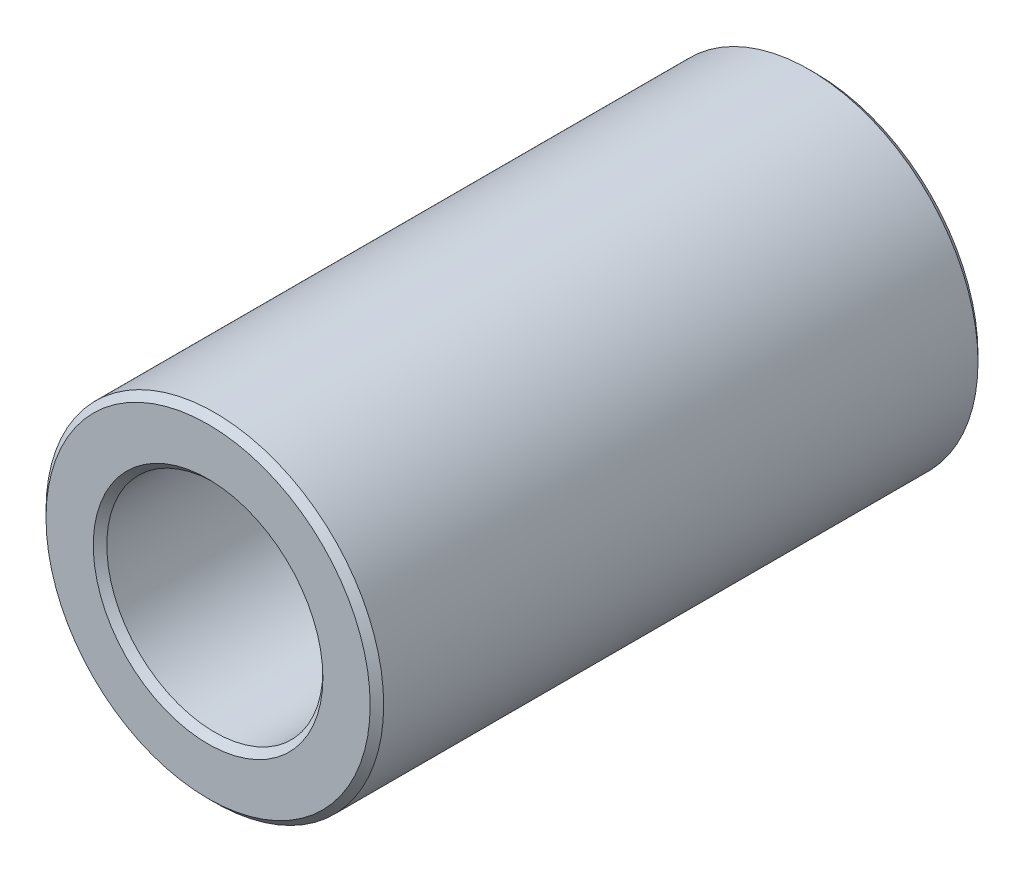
from build123d import *

# Parameters (mm, degrees)
SKETCH1_R           = 5
SKETCH1_R_2         = 3.2
BOSS_EXTRUDE2_DEPTH = 9
CHAMFER3_SIZE       = 0.2


with BuildPart() as part:
    # Sketch1 → Boss-Extrude2 (new, symmetric)
    with BuildSketch(Plane.XY):
        Circle(SKETCH1_R)
        Circle(SKETCH1_R_2, mode=Mode.SUBTRACT)
    extrude(amount=BOSS_EXTRUDE2_DEPTH, both=True)

    # Chamfer3
    chamfer3_edges = [part.edges().sort_by_distance(p)[0] for p in [
        (-5, 0, -9),
        (-5, 0, 9),
        (-3.2, 0, -9),
        (-3.2, 0, 9),
    ]]
    chamfer(chamfer3_edges, length=CHAMFER3_SIZE)


solid = part.part
